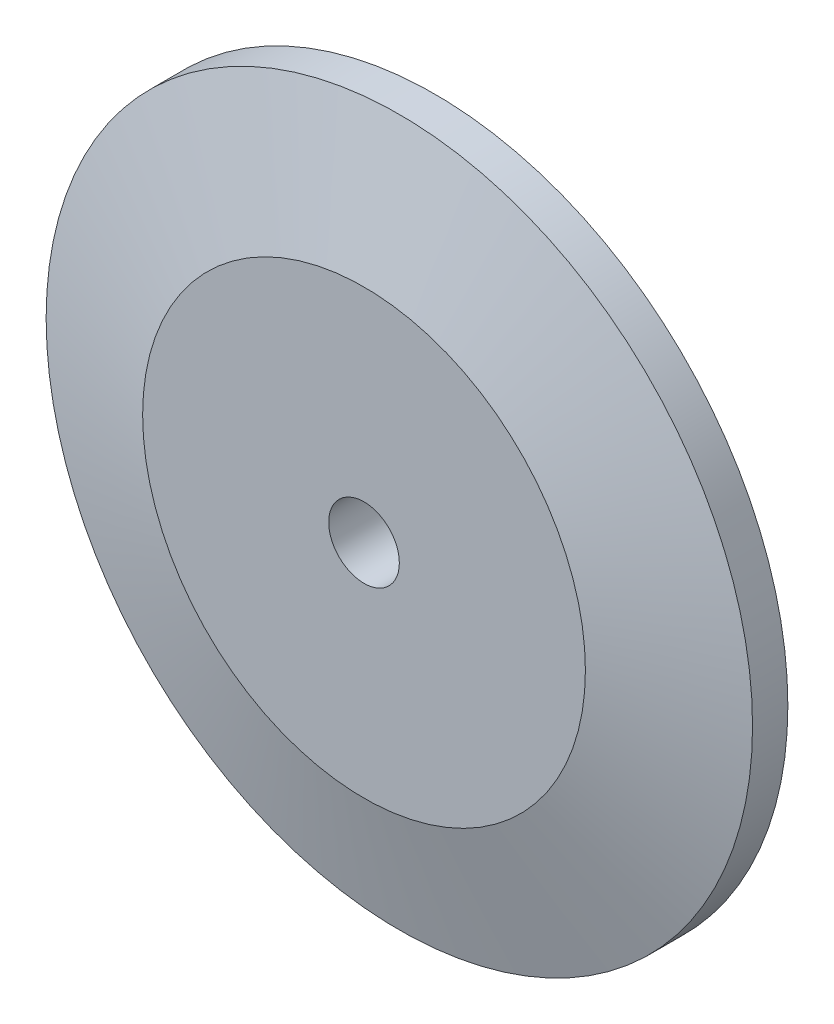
ISO-10303-21;
HEADER;
FILE_DESCRIPTION(('STEP AP214'),'2;1');
FILE_NAME('part.step','',(''),(''),'','','');
FILE_SCHEMA(('AUTOMOTIVE_DESIGN { 1 0 10303 214 1 1 1 1 }'));
ENDSEC;
DATA;
#1=APPLICATION_CONTEXT('core data for automotive mechanical design processes');
#2=APPLICATION_PROTOCOL_DEFINITION('international standard','automotive_design',2000,#1);
#3=PRODUCT_CONTEXT('',#1,'mechanical');
#4=PRODUCT('Part','Part','',(#3));
#5=PRODUCT_RELATED_PRODUCT_CATEGORY('part','',(#4));
#6=PRODUCT_DEFINITION_FORMATION('','',#4);
#7=PRODUCT_DEFINITION_CONTEXT('part definition',#1,'design');
#8=PRODUCT_DEFINITION('design','',#6,#7);
#9=PRODUCT_DEFINITION_SHAPE('','',#8);
#10=(LENGTH_UNIT() NAMED_UNIT(*) SI_UNIT(.MILLI.,.METRE.));
#11=(NAMED_UNIT(*) PLANE_ANGLE_UNIT() SI_UNIT($,.RADIAN.));
#12=(NAMED_UNIT(*) SI_UNIT($,.STERADIAN.) SOLID_ANGLE_UNIT());
#13=UNCERTAINTY_MEASURE_WITH_UNIT(LENGTH_MEASURE(1.E-05),#10,'distance_accuracy_value','');
#14=(GEOMETRIC_REPRESENTATION_CONTEXT(3) GLOBAL_UNCERTAINTY_ASSIGNED_CONTEXT((#13)) GLOBAL_UNIT_ASSIGNED_CONTEXT((#10,
#11,#12)) REPRESENTATION_CONTEXT('',''));
#15=CARTESIAN_POINT('',(0.,0.,0.));
#16=DIRECTION('',(0.,0.,1.));
#17=DIRECTION('',(1.,0.,0.));
#18=AXIS2_PLACEMENT_3D('',#15,#16,#17);
#19=CARTESIAN_POINT('',(0.,0.,2.54));
#20=DIRECTION('',(0.,0.,-1.));
#21=DIRECTION('',(-1.,0.,0.));
#22=AXIS2_PLACEMENT_3D('',#19,#20,#21);
#23=CYLINDRICAL_SURFACE('',#22,25.4);
#24=CARTESIAN_POINT('',(0.,0.,2.54));
#25=DIRECTION('',(0.,0.,1.));
#26=DIRECTION('',(1.,0.,0.));
#27=AXIS2_PLACEMENT_3D('',#24,#25,#26);
#28=CIRCLE('',#27,25.4);
#29=CARTESIAN_POINT('',(25.4,0.,2.54));
#30=VERTEX_POINT('',#29);
#31=EDGE_CURVE('E10',#30,#30,#28,.T.);
#32=ORIENTED_EDGE('',*,*,#31,.F.);
#33=EDGE_LOOP('',(#32));
#34=FACE_BOUND('',#33,.T.);
#35=CARTESIAN_POINT('',(0.,0.,0.));
#36=DIRECTION('',(0.,0.,1.));
#37=DIRECTION('',(1.,0.,0.));
#38=AXIS2_PLACEMENT_3D('',#35,#36,#37);
#39=CIRCLE('',#38,25.4);
#40=CARTESIAN_POINT('',(25.4,0.,0.));
#41=VERTEX_POINT('',#40);
#42=EDGE_CURVE('E36',#41,#41,#39,.T.);
#43=ORIENTED_EDGE('',*,*,#42,.T.);
#44=EDGE_LOOP('',(#43));
#45=FACE_BOUND('',#44,.T.);
#46=ADVANCED_FACE('F33',(#34,#45),#23,.T.);
#47=CARTESIAN_POINT('',(0.,0.,0.));
#48=DIRECTION('',(0.,0.,1.));
#49=DIRECTION('',(1.,0.,0.));
#50=AXIS2_PLACEMENT_3D('',#47,#48,#49);
#51=PLANE('',#50);
#52=CARTESIAN_POINT('',(0.,0.,0.));
#53=DIRECTION('',(0.,0.,1.));
#54=DIRECTION('',(1.,0.,0.));
#55=AXIS2_PLACEMENT_3D('',#52,#53,#54);
#56=CIRCLE('',#55,2.54);
#57=CARTESIAN_POINT('',(2.54,0.,0.));
#58=VERTEX_POINT('',#57);
#59=EDGE_CURVE('E47',#58,#58,#56,.T.);
#60=ORIENTED_EDGE('',*,*,#59,.T.);
#61=EDGE_LOOP('',(#60));
#62=FACE_BOUND('',#61,.T.);
#63=ORIENTED_EDGE('',*,*,#42,.F.);
#64=EDGE_LOOP('',(#63));
#65=FACE_BOUND('',#64,.T.);
#66=ADVANCED_FACE('F65',(#62,#65),#51,.F.);
#67=CARTESIAN_POINT('',(0.,0.,2.54));
#68=DIRECTION('',(0.,0.,-1.));
#69=DIRECTION('',(1.,0.,0.));
#70=AXIS2_PLACEMENT_3D('',#67,#68,#69);
#71=CONICAL_SURFACE('',#70,25.4,1.30899693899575);
#72=CARTESIAN_POINT('',(0.,0.,5.08));
#73=DIRECTION('',(0.,0.,1.));
#74=DIRECTION('',(1.,0.,0.));
#75=AXIS2_PLACEMENT_3D('',#72,#73,#74);
#76=CIRCLE('',#75,15.920590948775);
#77=CARTESIAN_POINT('',(15.920590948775,0.,5.08));
#78=VERTEX_POINT('',#77);
#79=EDGE_CURVE('E43',#78,#78,#76,.T.);
#80=ORIENTED_EDGE('',*,*,#79,.F.);
#81=EDGE_LOOP('',(#80));
#82=FACE_BOUND('',#81,.T.);
#83=ORIENTED_EDGE('',*,*,#31,.T.);
#84=EDGE_LOOP('',(#83));
#85=FACE_BOUND('',#84,.T.);
#86=ADVANCED_FACE('F60',(#82,#85),#71,.T.);
#87=CARTESIAN_POINT('',(0.,0.,5.08));
#88=DIRECTION('',(0.,0.,1.));
#89=DIRECTION('',(1.,0.,0.));
#90=AXIS2_PLACEMENT_3D('',#87,#88,#89);
#91=PLANE('',#90);
#92=CARTESIAN_POINT('',(0.,0.,5.08));
#93=DIRECTION('',(0.,0.,1.));
#94=DIRECTION('',(1.,0.,0.));
#95=AXIS2_PLACEMENT_3D('',#92,#93,#94);
#96=CIRCLE('',#95,2.54);
#97=CARTESIAN_POINT('',(2.54,0.,5.08));
#98=VERTEX_POINT('',#97);
#99=EDGE_CURVE('E50',#98,#98,#96,.T.);
#100=ORIENTED_EDGE('',*,*,#99,.F.);
#101=EDGE_LOOP('',(#100));
#102=FACE_BOUND('',#101,.T.);
#103=ORIENTED_EDGE('',*,*,#79,.T.);
#104=EDGE_LOOP('',(#103));
#105=FACE_BOUND('',#104,.T.);
#106=ADVANCED_FACE('F57',(#102,#105),#91,.T.);
#107=CARTESIAN_POINT('',(0.,0.,-9.144));
#108=DIRECTION('',(0.,0.,1.));
#109=DIRECTION('',(1.,0.,0.));
#110=AXIS2_PLACEMENT_3D('',#107,#108,#109);
#111=CYLINDRICAL_SURFACE('',#110,2.54);
#112=ORIENTED_EDGE('',*,*,#99,.T.);
#113=EDGE_LOOP('',(#112));
#114=FACE_BOUND('',#113,.T.);
#115=ORIENTED_EDGE('',*,*,#59,.F.);
#116=EDGE_LOOP('',(#115));
#117=FACE_BOUND('',#116,.T.);
#118=ADVANCED_FACE('F54',(#114,#117),#111,.F.);
#119=CLOSED_SHELL('',(#46,#66,#86,#106,#118));
#120=MANIFOLD_SOLID_BREP('B2',#119);
#121=ADVANCED_BREP_SHAPE_REPRESENTATION('',(#18,#120),#14);
#122=SHAPE_DEFINITION_REPRESENTATION(#9,#121);
ENDSEC;
END-ISO-10303-21;
